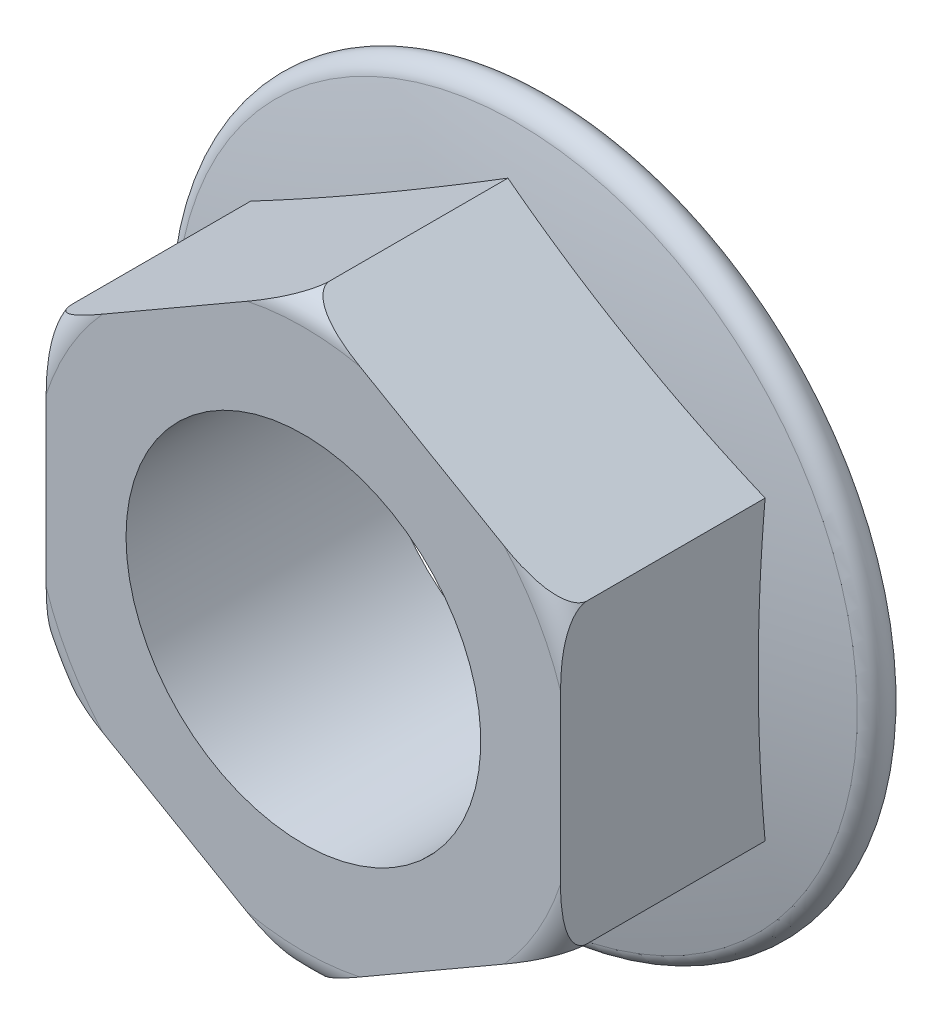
from build123d import *

# Parameters (mm, degrees)
HEAD_DEPTH              = 28
ESQUISSE1_R             = 20
ENL_V_MAT_EXTRU_1_DEPTH = 64.118935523


with BuildPart() as part:
    # Head Sketch → Head (new body)
    with BuildSketch(Plane.XY):
        Polygon((0, 33.486315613), (29, 16.743157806), (29, -16.743157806), (0, -33.486315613), (-29, -16.743157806), (-29, 16.743157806), align=None)
    extrude(amount=HEAD_DEPTH)

    # Flange Sketch → Flange (revolve)
    with BuildSketch(Plane(origin=(0, 0, 0), x_dir=(-1, 0, 0), z_dir=(0, 1, 0)), mode=Mode.PRIVATE) as flange_sk:
        with BuildLine():
            Line((-38, 0), (0, 0))
            Line((0, 0), (0, 8))
            ThreePointArc((0, 8), (-19.314342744, 6.986256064), (-38.416438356, 3.956164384))
            ThreePointArc((-38.416438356, 3.956164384), (-39.989010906, 1.790630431), (-38, 0))
        make_face()
    revolve(flange_sk.sketch.rotate(Axis((0, 0, 1.843425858), (0, 0, 1)), 180), axis=Axis((0, 0, 1.843425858), (0, 0, 1)))

    # Sketch5 → Head Trim (revolve, cut)
    with BuildSketch(Plane(origin=(0, 0, 0), x_dir=(0, 0, -1), z_dir=(1, 0, 0)), mode=Mode.PRIVATE) as head_trim_sk:
        with BuildLine():
            Line((-28, -30.486315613), (-28, -33.486315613))
            Line((-28, -33.486315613), (-25, -33.486315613))
            ThreePointArc((-25, -33.486315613), (-27.121320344, -32.607635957), (-28, -30.486315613))
        make_face()
    revolve(head_trim_sk.sketch.rotate(Axis((0, 0, 15.085599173), (0, 0, -1)), 240), axis=Axis((0, 0, 15.085599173), (0, 0, -1)), mode=Mode.SUBTRACT)

    # Esquisse1 → Enl_v. mat.-Extru.1 (cut, through all)
    with BuildSketch(Plane(origin=(0, 0, 0), x_dir=(-1, 0, 0), z_dir=(0, 0, -1))):
        Circle(ESQUISSE1_R)
    extrude(amount=-ENL_V_MAT_EXTRU_1_DEPTH, mode=Mode.SUBTRACT)


solid = part.part
